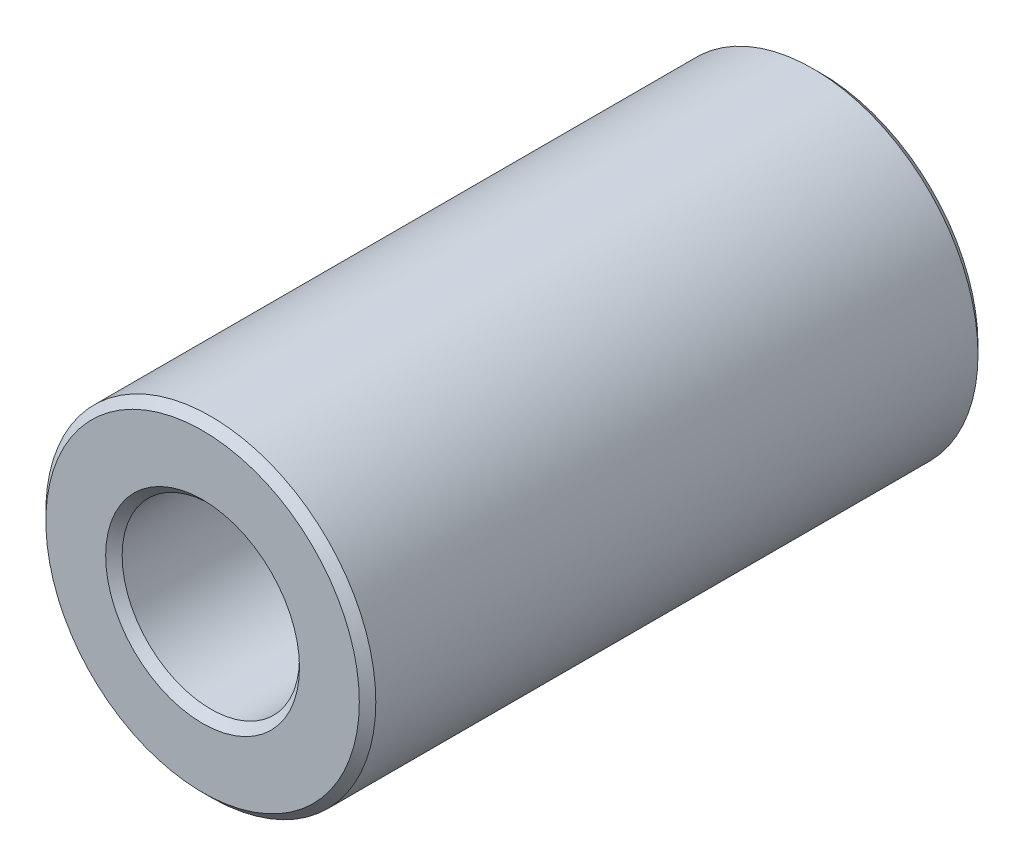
from build123d import *

# Parameters (mm, degrees)
SKETCH1_R           = 4
SKETCH1_R_2         = 2.15
BOSS_EXTRUDE2_DEPTH = 7.5
CHAMFER3_SIZE       = 0.2


with BuildPart() as part:
    # Sketch1 → Boss-Extrude2 (new, symmetric)
    with BuildSketch(Plane.XY):
        Circle(SKETCH1_R)
        Circle(SKETCH1_R_2, mode=Mode.SUBTRACT)
    extrude(amount=BOSS_EXTRUDE2_DEPTH, both=True)

    # Chamfer3
    chamfer3_edges = [part.edges().sort_by_distance(p)[0] for p in [
        (-4, 0, -7.5),
        (-4, 0, 7.5),
        (-2.15, 0, -7.5),
        (-2.15, 0, 7.5),
    ]]
    chamfer(chamfer3_edges, length=CHAMFER3_SIZE)


solid = part.part
